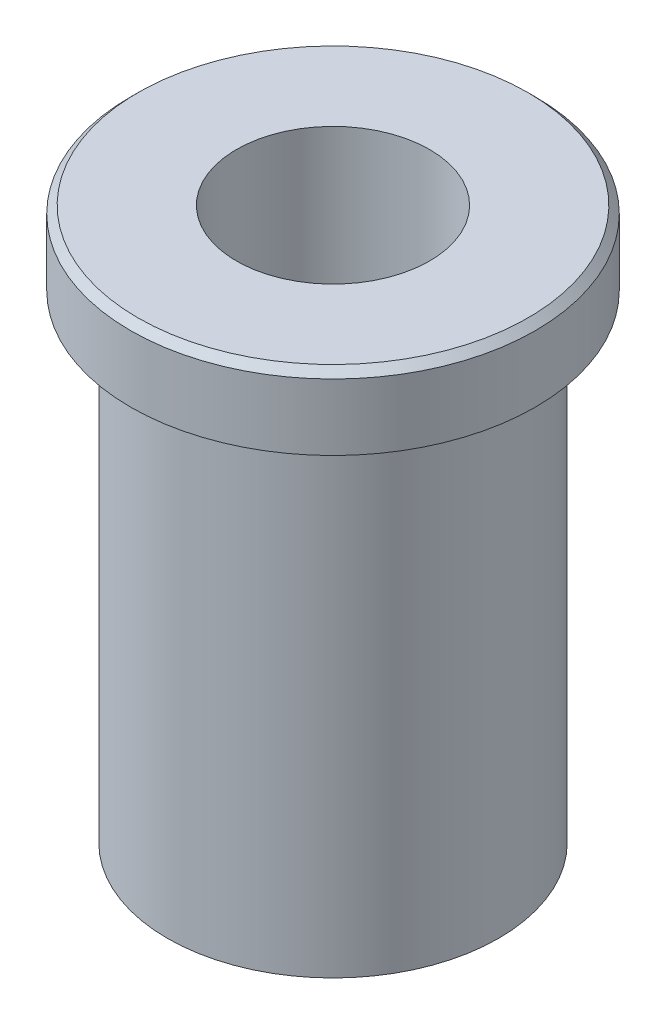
ISO-10303-21;
HEADER;
FILE_DESCRIPTION(('STEP AP214'),'2;1');
FILE_NAME('part.step','',(''),(''),'','','');
FILE_SCHEMA(('AUTOMOTIVE_DESIGN { 1 0 10303 214 1 1 1 1 }'));
ENDSEC;
DATA;
#1=APPLICATION_CONTEXT('core data for automotive mechanical design processes');
#2=APPLICATION_PROTOCOL_DEFINITION('international standard','automotive_design',2000,#1);
#3=PRODUCT_CONTEXT('',#1,'mechanical');
#4=PRODUCT('Part','Part','',(#3));
#5=PRODUCT_RELATED_PRODUCT_CATEGORY('part','',(#4));
#6=PRODUCT_DEFINITION_FORMATION('','',#4);
#7=PRODUCT_DEFINITION_CONTEXT('part definition',#1,'design');
#8=PRODUCT_DEFINITION('design','',#6,#7);
#9=PRODUCT_DEFINITION_SHAPE('','',#8);
#10=(LENGTH_UNIT() NAMED_UNIT(*) SI_UNIT(.MILLI.,.METRE.));
#11=(NAMED_UNIT(*) PLANE_ANGLE_UNIT() SI_UNIT($,.RADIAN.));
#12=(NAMED_UNIT(*) SI_UNIT($,.STERADIAN.) SOLID_ANGLE_UNIT());
#13=UNCERTAINTY_MEASURE_WITH_UNIT(LENGTH_MEASURE(1.E-05),#10,'distance_accuracy_value','');
#14=(GEOMETRIC_REPRESENTATION_CONTEXT(3) GLOBAL_UNCERTAINTY_ASSIGNED_CONTEXT((#13)) GLOBAL_UNIT_ASSIGNED_CONTEXT((#10,
#11,#12)) REPRESENTATION_CONTEXT('',''));
#15=CARTESIAN_POINT('',(0.,0.,0.));
#16=DIRECTION('',(0.,0.,1.));
#17=DIRECTION('',(1.,0.,0.));
#18=AXIS2_PLACEMENT_3D('',#15,#16,#17);
#19=CARTESIAN_POINT('',(0.,-26.,0.));
#20=DIRECTION('',(0.,-1.,0.));
#21=DIRECTION('',(0.,0.,-1.));
#22=AXIS2_PLACEMENT_3D('',#19,#20,#21);
#23=CYLINDRICAL_SURFACE('',#22,5.25);
#24=CARTESIAN_POINT('',(0.,-26.,0.));
#25=DIRECTION('',(0.,-1.,0.));
#26=DIRECTION('',(0.,0.,-1.));
#27=AXIS2_PLACEMENT_3D('',#24,#25,#26);
#28=CIRCLE('',#27,5.25);
#29=CARTESIAN_POINT('',(0.,-26.,-5.25));
#30=VERTEX_POINT('',#29);
#31=EDGE_CURVE('E10',#30,#30,#28,.T.);
#32=ORIENTED_EDGE('',*,*,#31,.T.);
#33=EDGE_LOOP('',(#32));
#34=FACE_BOUND('',#33,.T.);
#35=CARTESIAN_POINT('',(0.,4.,0.));
#36=DIRECTION('',(0.,-1.,0.));
#37=DIRECTION('',(0.,0.,-1.));
#38=AXIS2_PLACEMENT_3D('',#35,#36,#37);
#39=CIRCLE('',#38,5.25);
#40=CARTESIAN_POINT('',(0.,4.,-5.25));
#41=VERTEX_POINT('',#40);
#42=EDGE_CURVE('E61',#41,#41,#39,.T.);
#43=ORIENTED_EDGE('',*,*,#42,.F.);
#44=EDGE_LOOP('',(#43));
#45=FACE_BOUND('',#44,.T.);
#46=ADVANCED_FACE('F15',(#34,#45),#23,.F.);
#47=CARTESIAN_POINT('',(5.25,-26.,0.));
#48=DIRECTION('',(0.,-1.,0.));
#49=DIRECTION('',(0.,0.,-1.));
#50=AXIS2_PLACEMENT_3D('',#47,#48,#49);
#51=PLANE('',#50);
#52=CARTESIAN_POINT('',(0.,-26.,0.));
#53=DIRECTION('',(0.,-1.,0.));
#54=DIRECTION('',(0.,0.,-1.));
#55=AXIS2_PLACEMENT_3D('',#52,#53,#54);
#56=CIRCLE('',#55,9.);
#57=CARTESIAN_POINT('',(0.,-26.,-9.));
#58=VERTEX_POINT('',#57);
#59=EDGE_CURVE('E22',#58,#58,#56,.T.);
#60=ORIENTED_EDGE('',*,*,#59,.T.);
#61=EDGE_LOOP('',(#60));
#62=FACE_BOUND('',#61,.T.);
#63=ORIENTED_EDGE('',*,*,#31,.F.);
#64=EDGE_LOOP('',(#63));
#65=FACE_BOUND('',#64,.T.);
#66=ADVANCED_FACE('F70',(#62,#65),#51,.T.);
#67=CARTESIAN_POINT('',(0.,-26.,0.));
#68=DIRECTION('',(0.,-1.,0.));
#69=DIRECTION('',(0.,0.,-1.));
#70=AXIS2_PLACEMENT_3D('',#67,#68,#69);
#71=CYLINDRICAL_SURFACE('',#70,9.);
#72=CARTESIAN_POINT('',(0.,-0.75,0.));
#73=DIRECTION('',(0.,-1.,0.));
#74=DIRECTION('',(0.,0.,-1.));
#75=AXIS2_PLACEMENT_3D('',#72,#73,#74);
#76=CIRCLE('',#75,9.);
#77=CARTESIAN_POINT('',(0.,-0.75,-9.));
#78=VERTEX_POINT('',#77);
#79=EDGE_CURVE('E31',#78,#78,#76,.T.);
#80=ORIENTED_EDGE('',*,*,#79,.T.);
#81=EDGE_LOOP('',(#80));
#82=FACE_BOUND('',#81,.T.);
#83=ORIENTED_EDGE('',*,*,#59,.F.);
#84=EDGE_LOOP('',(#83));
#85=FACE_BOUND('',#84,.T.);
#86=ADVANCED_FACE('F75',(#82,#85),#71,.T.);
#87=CARTESIAN_POINT('',(9.,-0.75,0.));
#88=DIRECTION('',(0.,1.,0.));
#89=DIRECTION('',(0.,0.,1.));
#90=AXIS2_PLACEMENT_3D('',#87,#88,#89);
#91=PLANE('',#90);
#92=CARTESIAN_POINT('',(0.,-0.75,0.));
#93=DIRECTION('',(0.,-1.,0.));
#94=DIRECTION('',(0.,0.,-1.));
#95=AXIS2_PLACEMENT_3D('',#92,#93,#94);
#96=CIRCLE('',#95,8.25);
#97=CARTESIAN_POINT('',(0.,-0.75,-8.25));
#98=VERTEX_POINT('',#97);
#99=EDGE_CURVE('E39',#98,#98,#96,.T.);
#100=ORIENTED_EDGE('',*,*,#99,.T.);
#101=EDGE_LOOP('',(#100));
#102=FACE_BOUND('',#101,.T.);
#103=ORIENTED_EDGE('',*,*,#79,.F.);
#104=EDGE_LOOP('',(#103));
#105=FACE_BOUND('',#104,.T.);
#106=ADVANCED_FACE('F79',(#102,#105),#91,.T.);
#107=CARTESIAN_POINT('',(0.,-26.,0.));
#108=DIRECTION('',(0.,-1.,0.));
#109=DIRECTION('',(0.,0.,-1.));
#110=AXIS2_PLACEMENT_3D('',#107,#108,#109);
#111=CYLINDRICAL_SURFACE('',#110,8.25);
#112=CARTESIAN_POINT('',(0.,0.,0.));
#113=DIRECTION('',(0.,-1.,0.));
#114=DIRECTION('',(0.,0.,-1.));
#115=AXIS2_PLACEMENT_3D('',#112,#113,#114);
#116=CIRCLE('',#115,8.25);
#117=CARTESIAN_POINT('',(0.,0.,-8.25));
#118=VERTEX_POINT('',#117);
#119=EDGE_CURVE('E45',#118,#118,#116,.T.);
#120=ORIENTED_EDGE('',*,*,#119,.T.);
#121=EDGE_LOOP('',(#120));
#122=FACE_BOUND('',#121,.T.);
#123=ORIENTED_EDGE('',*,*,#99,.F.);
#124=EDGE_LOOP('',(#123));
#125=FACE_BOUND('',#124,.T.);
#126=ADVANCED_FACE('F86',(#122,#125),#111,.T.);
#127=CARTESIAN_POINT('',(8.25,0.,0.));
#128=DIRECTION('',(0.,-1.,0.));
#129=DIRECTION('',(0.,0.,-1.));
#130=AXIS2_PLACEMENT_3D('',#127,#128,#129);
#131=PLANE('',#130);
#132=CARTESIAN_POINT('',(0.,0.,0.));
#133=DIRECTION('',(0.,-1.,0.));
#134=DIRECTION('',(0.,0.,-1.));
#135=AXIS2_PLACEMENT_3D('',#132,#133,#134);
#136=CIRCLE('',#135,11.);
#137=CARTESIAN_POINT('',(0.,0.,-11.));
#138=VERTEX_POINT('',#137);
#139=EDGE_CURVE('E49',#138,#138,#136,.T.);
#140=ORIENTED_EDGE('',*,*,#139,.T.);
#141=EDGE_LOOP('',(#140));
#142=FACE_BOUND('',#141,.T.);
#143=ORIENTED_EDGE('',*,*,#119,.F.);
#144=EDGE_LOOP('',(#143));
#145=FACE_BOUND('',#144,.T.);
#146=ADVANCED_FACE('F90',(#142,#145),#131,.T.);
#147=CARTESIAN_POINT('',(0.,-26.,0.));
#148=DIRECTION('',(0.,-1.,0.));
#149=DIRECTION('',(0.,0.,-1.));
#150=AXIS2_PLACEMENT_3D('',#147,#148,#149);
#151=CYLINDRICAL_SURFACE('',#150,11.);
#152=CARTESIAN_POINT('',(0.,3.6,0.));
#153=DIRECTION('',(0.,-1.,0.));
#154=DIRECTION('',(0.,0.,-1.));
#155=AXIS2_PLACEMENT_3D('',#152,#153,#154);
#156=CIRCLE('',#155,11.);
#157=CARTESIAN_POINT('',(0.,3.6,-11.));
#158=VERTEX_POINT('',#157);
#159=EDGE_CURVE('E53',#158,#158,#156,.T.);
#160=ORIENTED_EDGE('',*,*,#159,.T.);
#161=EDGE_LOOP('',(#160));
#162=FACE_BOUND('',#161,.T.);
#163=ORIENTED_EDGE('',*,*,#139,.F.);
#164=EDGE_LOOP('',(#163));
#165=FACE_BOUND('',#164,.T.);
#166=ADVANCED_FACE('F94',(#162,#165),#151,.T.);
#167=CARTESIAN_POINT('',(0.,3.6,0.));
#168=DIRECTION('',(0.,-1.,0.));
#169=DIRECTION('',(0.,0.,-1.));
#170=AXIS2_PLACEMENT_3D('',#167,#168,#169);
#171=CONICAL_SURFACE('',#170,11.,0.785398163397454);
#172=CARTESIAN_POINT('',(0.,4.,0.));
#173=DIRECTION('',(0.,-1.,0.));
#174=DIRECTION('',(0.,0.,-1.));
#175=AXIS2_PLACEMENT_3D('',#172,#173,#174);
#176=CIRCLE('',#175,10.6);
#177=CARTESIAN_POINT('',(0.,4.,-10.6));
#178=VERTEX_POINT('',#177);
#179=EDGE_CURVE('E57',#178,#178,#176,.T.);
#180=ORIENTED_EDGE('',*,*,#179,.T.);
#181=EDGE_LOOP('',(#180));
#182=FACE_BOUND('',#181,.T.);
#183=ORIENTED_EDGE('',*,*,#159,.F.);
#184=EDGE_LOOP('',(#183));
#185=FACE_BOUND('',#184,.T.);
#186=ADVANCED_FACE('F98',(#182,#185),#171,.T.);
#187=CARTESIAN_POINT('',(10.6,4.,0.));
#188=DIRECTION('',(0.,1.,0.));
#189=DIRECTION('',(0.,0.,1.));
#190=AXIS2_PLACEMENT_3D('',#187,#188,#189);
#191=PLANE('',#190);
#192=ORIENTED_EDGE('',*,*,#42,.T.);
#193=EDGE_LOOP('',(#192));
#194=FACE_BOUND('',#193,.T.);
#195=ORIENTED_EDGE('',*,*,#179,.F.);
#196=EDGE_LOOP('',(#195));
#197=FACE_BOUND('',#196,.T.);
#198=ADVANCED_FACE('F66',(#194,#197),#191,.T.);
#199=CLOSED_SHELL('',(#46,#66,#86,#106,#126,#146,#166,#186,#198));
#200=MANIFOLD_SOLID_BREP('B1',#199);
#201=ADVANCED_BREP_SHAPE_REPRESENTATION('',(#18,#200),#14);
#202=SHAPE_DEFINITION_REPRESENTATION(#9,#201);
ENDSEC;
END-ISO-10303-21;
